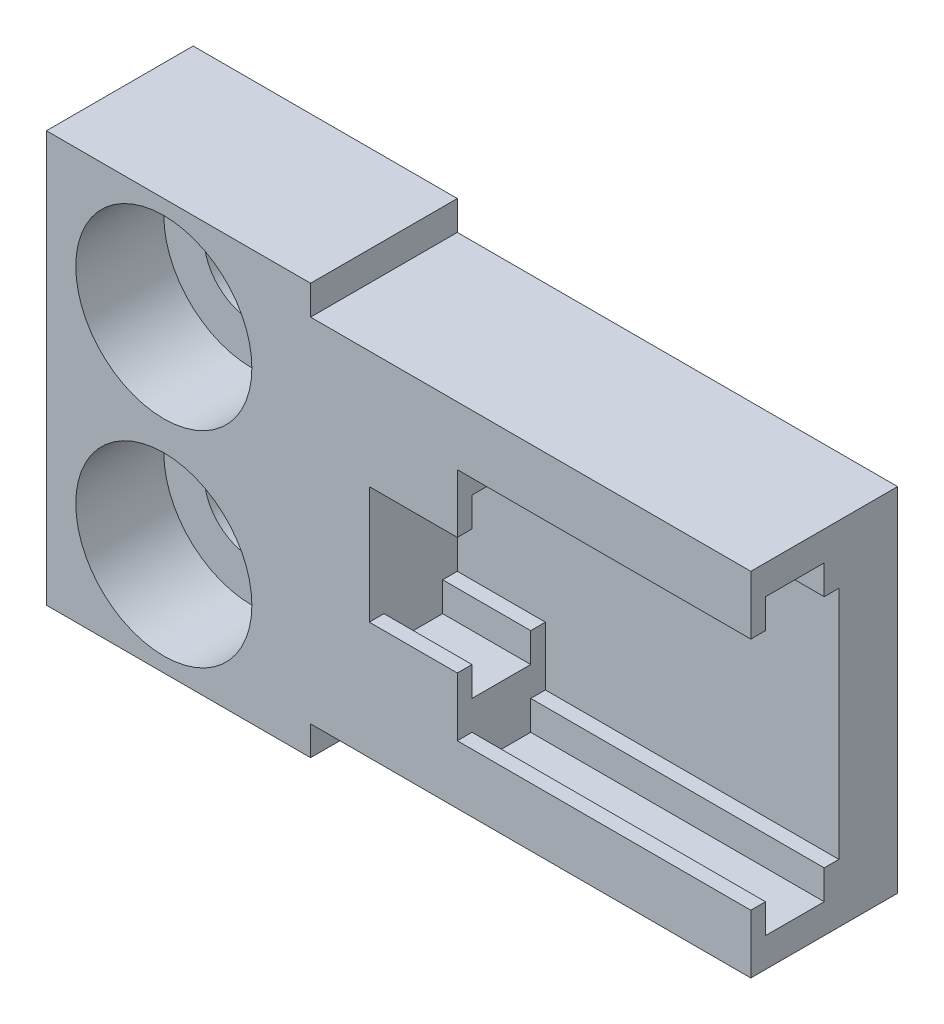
from build123d import *

# Parameters (mm, degrees)
CROQUIS1_W              = 15
CROQUIS1_H              = 12
SALIENTE_EXTRUIR1_DEPTH = 5
SALIENTE_EXTRUIR2_DEPTH = 5
CROQUIS25_R             = 3
CORTAR_EXTRUIR21_DEPTH  = 3
CROQUIS26_R             = 1.625
CORTAR_EXTRUIR22_DEPTH  = 4
CORTAR_EXTRUIR25_DEPTH  = 3
CROQUIS33_W             = 2
CROQUIS33_H             = 1
CORTAR_EXTRUIR26_DEPTH  = 10
CROQUIS34_W             = 2
CROQUIS34_H             = 1
CORTAR_EXTRUIR27_DEPTH  = 3


with BuildPart() as part:
    # Croquis1 → Saliente-Extruir1 (new body)
    with BuildSketch(Plane.XY):
        Rectangle(CROQUIS1_W, CROQUIS1_H)
    extrude(amount=SALIENTE_EXTRUIR1_DEPTH)

    # Croquis14 → Saliente-Extruir2 (add)
    with BuildSketch(Plane(origin=(0, 0, 0), x_dir=(-1, 0, 0), z_dir=(0, 0, -1))):
        Polygon((7.5, -6), (7.5, -7), (16.5, -7), (16.5, 7), (7.5, 7), (7.5, 6), align=None)
    extrude(amount=-SALIENTE_EXTRUIR2_DEPTH)

    # Croquis25 → Cortar-Extruir21 (cut)
    with BuildSketch(Plane.XY.offset(5)):
        with Locations((-12.500230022, -3.5)):
            Circle(CROQUIS25_R)
        with Locations((-12.500230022, 3.5)):
            Circle(CROQUIS25_R)
    extrude(amount=-CORTAR_EXTRUIR21_DEPTH, mode=Mode.SUBTRACT)

    # Croquis26 → Cortar-Extruir22 (cut)
    with BuildSketch(Plane.XY.offset(2)):
        with Locations((-12.500230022, -3.5)):
            Circle(CROQUIS26_R)
        with Locations((-12.500230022, 3.5)):
            Circle(CROQUIS26_R)
    extrude(amount=-CORTAR_EXTRUIR22_DEPTH, mode=Mode.SUBTRACT)

    # Croquis32 → Cortar-Extruir25 (cut)
    with BuildSketch(Plane.XY.offset(5)):
        Polygon((7.5, 4), (-2.5, 4), (-2.5, 2), (-5.5, 2), (-5.5, -2), (-2.5, -2), (-2.5, -4), (7.5, -4), align=None)
    extrude(amount=-CORTAR_EXTRUIR25_DEPTH, mode=Mode.SUBTRACT)

    # Croquis33 → Cortar-Extruir26 (cut)
    with BuildSketch(Plane(origin=(7.5, 0, 0), x_dir=(0, 0, -1), z_dir=(1, 0, 0))):
        with Locations((-3.5, 4.5)):
            Rectangle(CROQUIS33_W, CROQUIS33_H)
        with Locations((-3.5, -4.5)):
            Rectangle(CROQUIS33_W, CROQUIS33_H)
    extrude(amount=-CORTAR_EXTRUIR26_DEPTH, mode=Mode.SUBTRACT)

    # Croquis34 → Cortar-Extruir27 (cut)
    with BuildSketch(Plane(origin=(-2.5, 0, 0), x_dir=(0, 0, -1), z_dir=(1, 0, 0))):
        with Locations((-3.5, 2.5)):
            Rectangle(CROQUIS34_W, CROQUIS34_H)
        with Locations((-3.5, -2.5)):
            Rectangle(CROQUIS34_W, CROQUIS34_H)
    extrude(amount=-CORTAR_EXTRUIR27_DEPTH, mode=Mode.SUBTRACT)


solid = part.part
